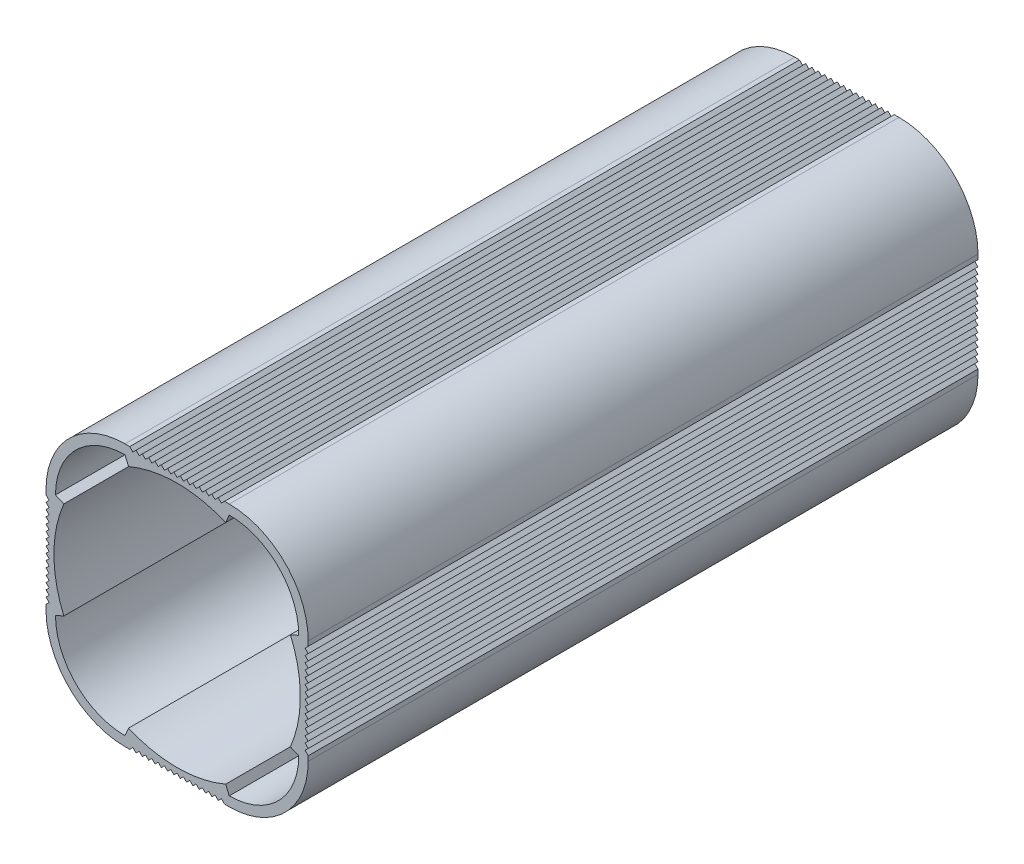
from build123d import *

# Parameters (mm, degrees)
ESQUISSE1_W                          = 83
ESQUISSE1_H                          = 83
BASE_EXTRUSION_DEPTH                 = 106
CONG_1_R                             = 25
ENL_V_MAT_EXTRU_1_DEPTH              = 220.973862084
ENL_V_MAT_EXTRU_2_DEPTH              = 220.973862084
R_P_TITION_LIN_AIRE1_COUNT           = 15
R_P_TITION_LIN_AIRE1_PITCH           = 2
R_P_TITION_CIRCULAIRE1_COUNT         = 4
R_P_TITION_CIRCULAIRE1_COPY_1_DEPTH  = 220.973862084
R_P_TITION_CIRCULAIRE1_COPY_2_DEPTH  = 220.973862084
R_P_TITION_CIRCULAIRE1_COPY_3_DEPTH  = 220.973862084
R_P_TITION_CIRCULAIRE1_COPY_4_DEPTH  = 220.973862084
R_P_TITION_CIRCULAIRE1_COPY_5_DEPTH  = 220.973862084
R_P_TITION_CIRCULAIRE1_COPY_6_DEPTH  = 220.973862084
R_P_TITION_CIRCULAIRE1_COPY_7_DEPTH  = 220.973862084
R_P_TITION_CIRCULAIRE1_COPY_8_DEPTH  = 220.973862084
R_P_TITION_CIRCULAIRE1_COPY_9_DEPTH  = 220.973862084
R_P_TITION_CIRCULAIRE1_COPY_10_DEPTH = 220.973862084
R_P_TITION_CIRCULAIRE1_COPY_11_DEPTH = 220.973862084
R_P_TITION_CIRCULAIRE1_COPY_12_DEPTH = 220.973862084
R_P_TITION_CIRCULAIRE1_COPY_13_DEPTH = 220.973862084
R_P_TITION_CIRCULAIRE1_COPY_14_DEPTH = 220.973862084
R_P_TITION_CIRCULAIRE1_COPY_15_DEPTH = 220.973862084
R_P_TITION_CIRCULAIRE1_COPY_16_DEPTH = 220.973862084
R_P_TITION_CIRCULAIRE1_COPY_17_DEPTH = 220.973862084
R_P_TITION_CIRCULAIRE1_COPY_18_DEPTH = 220.973862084
R_P_TITION_CIRCULAIRE1_COPY_19_DEPTH = 220.973862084
R_P_TITION_CIRCULAIRE1_COPY_20_DEPTH = 220.973862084
R_P_TITION_CIRCULAIRE1_COPY_21_DEPTH = 220.973862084
R_P_TITION_CIRCULAIRE1_COPY_22_DEPTH = 220.973862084
R_P_TITION_CIRCULAIRE1_COPY_23_DEPTH = 220.973862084
R_P_TITION_CIRCULAIRE1_COPY_24_DEPTH = 220.973862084
R_P_TITION_CIRCULAIRE1_COPY_25_DEPTH = 220.973862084
R_P_TITION_CIRCULAIRE1_COPY_26_DEPTH = 220.973862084
R_P_TITION_CIRCULAIRE1_COPY_27_DEPTH = 220.973862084
R_P_TITION_CIRCULAIRE1_COPY_28_DEPTH = 220.973862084
R_P_TITION_CIRCULAIRE1_COPY_29_DEPTH = 220.973862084
R_P_TITION_CIRCULAIRE1_COPY_30_DEPTH = 220.973862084
R_P_TITION_CIRCULAIRE1_COPY_31_DEPTH = 220.973862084
R_P_TITION_CIRCULAIRE1_COPY_32_DEPTH = 220.973862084
R_P_TITION_CIRCULAIRE1_COPY_33_DEPTH = 220.973862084
R_P_TITION_CIRCULAIRE1_COPY_34_DEPTH = 220.973862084
R_P_TITION_CIRCULAIRE1_COPY_35_DEPTH = 220.973862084
R_P_TITION_CIRCULAIRE1_COPY_36_DEPTH = 220.973862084
R_P_TITION_CIRCULAIRE1_COPY_37_DEPTH = 220.973862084
R_P_TITION_CIRCULAIRE1_COPY_38_DEPTH = 220.973862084
R_P_TITION_CIRCULAIRE1_COPY_39_DEPTH = 220.973862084
R_P_TITION_CIRCULAIRE1_COPY_40_DEPTH = 220.973862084
R_P_TITION_CIRCULAIRE1_COPY_41_DEPTH = 220.973862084
R_P_TITION_CIRCULAIRE1_COPY_42_DEPTH = 220.973862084


with BuildPart() as part:
    # Esquisse1 → Base-Extrusion (new, symmetric)
    with BuildSketch(Plane.XY):
        Rectangle(ESQUISSE1_W, ESQUISSE1_H)
    extrude(amount=BASE_EXTRUSION_DEPTH, both=True)

    # Cong_1
    cong_1_edges = [part.edges().sort_by_distance(p)[0] for p in [
        (-41.5, 41.5, 0),
        (41.5, 41.5, 0),
        (41.5, -41.5, 0),
        (-41.5, -41.5, 0),
    ]]
    fillet(cong_1_edges, radius=CONG_1_R)

    # Esquisse2 → Enl_v. mat.-Extru.1 (cut, through all)
    with BuildSketch(Plane.XY.offset(106)):
        with BuildLine():
            Line((15.362852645, 35.846656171), (16.5, 38.5))
            ThreePointArc((16.5, 38.5), (32.056349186, 32.056349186), (38.5, 16.5))
            Line((38.5, 16.5), (35.846656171, 15.362852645))
            ThreePointArc((35.846656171, 15.362852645), (39, 0), (35.846656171, -15.362852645))
            Line((35.846656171, -15.362852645), (38.5, -16.5))
            ThreePointArc((38.5, -16.5), (32.056349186, -32.056349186), (16.5, -38.5))
            Line((16.5, -38.5), (15.362852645, -35.846656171))
            ThreePointArc((15.362852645, -35.846656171), (0, -39), (-15.362852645, -35.846656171))
            Line((-15.362852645, -35.846656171), (-16.5, -38.5))
            ThreePointArc((-16.5, -38.5), (-32.056349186, -32.056349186), (-38.5, -16.5))
            Line((-38.5, -16.5), (-35.846656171, -15.362852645))
            ThreePointArc((-35.846656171, -15.362852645), (-39, 0), (-35.846656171, 15.362852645))
            Line((-35.846656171, 15.362852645), (-38.5, 16.5))
            ThreePointArc((-38.5, 16.5), (-32.056349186, 32.056349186), (-16.5, 38.5))
            Line((-16.5, 38.5), (-15.362852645, 35.846656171))
            ThreePointArc((-15.362852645, 35.846656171), (0, 39), (15.362852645, 35.846656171))
        make_face()
    extrude(amount=-ENL_V_MAT_EXTRU_1_DEPTH, mode=Mode.SUBTRACT)

    # Esquisse3 → Enl_v. mat.-Extru.2 (cut, through all)
    with BuildSketch(Plane.XY.offset(106)):
        Polygon((-15, 41.5), (-13, 41.5), (-14, 40.5), align=None)
    enl_v_mat_extru_2 = extrude(amount=-ENL_V_MAT_EXTRU_2_DEPTH, mode=Mode.SUBTRACT)

    # R_p_tition lin_aire1: Enl_v. mat.-Extru.2 ×15
    with Locations(*[(i * R_P_TITION_LIN_AIRE1_PITCH, 0, 0) for i in range(1, R_P_TITION_LIN_AIRE1_COUNT)]):
        add(enl_v_mat_extru_2, mode=Mode.SUBTRACT)

    # R_p_tition circulaire1: Enl_v. mat.-Extru.2 ×4 about axis
    r_p_tition_circulaire1_axis = Axis((0, 0, 0), (0, 0, 1))
    for i in range(1, R_P_TITION_CIRCULAIRE1_COUNT):
        add(enl_v_mat_extru_2.rotate(r_p_tition_circulaire1_axis, i * 360 / R_P_TITION_CIRCULAIRE1_COUNT), mode=Mode.SUBTRACT)

    # R_p_tition circulaire1 copy 1 sketch → R_p_tition circulaire1 copy 1 (cut, through all)
    with BuildSketch(Plane(origin=(0, 2, 106), x_dir=(0, 1, 0), z_dir=(0, 0, 1))):
        Polygon((-15, 41.5), (-13, 41.5), (-14, 40.5), align=None)
    extrude(amount=-R_P_TITION_CIRCULAIRE1_COPY_1_DEPTH, mode=Mode.SUBTRACT)

    # R_p_tition circulaire1 copy 2 sketch → R_p_tition circulaire1 copy 2 (cut, through all)
    with BuildSketch(Plane(origin=(-2, 0, 106), x_dir=(-1, 0, 0), z_dir=(0, 0, 1))):
        Polygon((-15, 41.5), (-13, 41.5), (-14, 40.5), align=None)
    extrude(amount=-R_P_TITION_CIRCULAIRE1_COPY_2_DEPTH, mode=Mode.SUBTRACT)

    # R_p_tition circulaire1 copy 3 sketch → R_p_tition circulaire1 copy 3 (cut, through all)
    with BuildSketch(Plane(origin=(0, -2, 106), x_dir=(0, -1, 0), z_dir=(0, 0, 1))):
        Polygon((-15, 41.5), (-13, 41.5), (-14, 40.5), align=None)
    extrude(amount=-R_P_TITION_CIRCULAIRE1_COPY_3_DEPTH, mode=Mode.SUBTRACT)

    # R_p_tition circulaire1 copy 4 sketch → R_p_tition circulaire1 copy 4 (cut, through all)
    with BuildSketch(Plane(origin=(0, 4, 106), x_dir=(0, 1, 0), z_dir=(0, 0, 1))):
        Polygon((-15, 41.5), (-13, 41.5), (-14, 40.5), align=None)
    extrude(amount=-R_P_TITION_CIRCULAIRE1_COPY_4_DEPTH, mode=Mode.SUBTRACT)

    # R_p_tition circulaire1 copy 5 sketch → R_p_tition circulaire1 copy 5 (cut, through all)
    with BuildSketch(Plane(origin=(-4, 0, 106), x_dir=(-1, 0, 0), z_dir=(0, 0, 1))):
        Polygon((-15, 41.5), (-13, 41.5), (-14, 40.5), align=None)
    extrude(amount=-R_P_TITION_CIRCULAIRE1_COPY_5_DEPTH, mode=Mode.SUBTRACT)

    # R_p_tition circulaire1 copy 6 sketch → R_p_tition circulaire1 copy 6 (cut, through all)
    with BuildSketch(Plane(origin=(0, -4, 106), x_dir=(0, -1, 0), z_dir=(0, 0, 1))):
        Polygon((-15, 41.5), (-13, 41.5), (-14, 40.5), align=None)
    extrude(amount=-R_P_TITION_CIRCULAIRE1_COPY_6_DEPTH, mode=Mode.SUBTRACT)

    # R_p_tition circulaire1 copy 7 sketch → R_p_tition circulaire1 copy 7 (cut, through all)
    with BuildSketch(Plane(origin=(0, 6, 106), x_dir=(0, 1, 0), z_dir=(0, 0, 1))):
        Polygon((-15, 41.5), (-13, 41.5), (-14, 40.5), align=None)
    extrude(amount=-R_P_TITION_CIRCULAIRE1_COPY_7_DEPTH, mode=Mode.SUBTRACT)

    # R_p_tition circulaire1 copy 8 sketch → R_p_tition circulaire1 copy 8 (cut, through all)
    with BuildSketch(Plane(origin=(-6, 0, 106), x_dir=(-1, 0, 0), z_dir=(0, 0, 1))):
        Polygon((-15, 41.5), (-13, 41.5), (-14, 40.5), align=None)
    extrude(amount=-R_P_TITION_CIRCULAIRE1_COPY_8_DEPTH, mode=Mode.SUBTRACT)

    # R_p_tition circulaire1 copy 9 sketch → R_p_tition circulaire1 copy 9 (cut, through all)
    with BuildSketch(Plane(origin=(0, -6, 106), x_dir=(0, -1, 0), z_dir=(0, 0, 1))):
        Polygon((-15, 41.5), (-13, 41.5), (-14, 40.5), align=None)
    extrude(amount=-R_P_TITION_CIRCULAIRE1_COPY_9_DEPTH, mode=Mode.SUBTRACT)

    # R_p_tition circulaire1 copy 10 sketch → R_p_tition circulaire1 copy 10 (cut, through all)
    with BuildSketch(Plane(origin=(0, 8, 106), x_dir=(0, 1, 0), z_dir=(0, 0, 1))):
        Polygon((-15, 41.5), (-13, 41.5), (-14, 40.5), align=None)
    extrude(amount=-R_P_TITION_CIRCULAIRE1_COPY_10_DEPTH, mode=Mode.SUBTRACT)

    # R_p_tition circulaire1 copy 11 sketch → R_p_tition circulaire1 copy 11 (cut, through all)
    with BuildSketch(Plane(origin=(-8, 0, 106), x_dir=(-1, 0, 0), z_dir=(0, 0, 1))):
        Polygon((-15, 41.5), (-13, 41.5), (-14, 40.5), align=None)
    extrude(amount=-R_P_TITION_CIRCULAIRE1_COPY_11_DEPTH, mode=Mode.SUBTRACT)

    # R_p_tition circulaire1 copy 12 sketch → R_p_tition circulaire1 copy 12 (cut, through all)
    with BuildSketch(Plane(origin=(0, -8, 106), x_dir=(0, -1, 0), z_dir=(0, 0, 1))):
        Polygon((-15, 41.5), (-13, 41.5), (-14, 40.5), align=None)
    extrude(amount=-R_P_TITION_CIRCULAIRE1_COPY_12_DEPTH, mode=Mode.SUBTRACT)

    # R_p_tition circulaire1 copy 13 sketch → R_p_tition circulaire1 copy 13 (cut, through all)
    with BuildSketch(Plane(origin=(0, 10, 106), x_dir=(0, 1, 0), z_dir=(0, 0, 1))):
        Polygon((-15, 41.5), (-13, 41.5), (-14, 40.5), align=None)
    extrude(amount=-R_P_TITION_CIRCULAIRE1_COPY_13_DEPTH, mode=Mode.SUBTRACT)

    # R_p_tition circulaire1 copy 14 sketch → R_p_tition circulaire1 copy 14 (cut, through all)
    with BuildSketch(Plane(origin=(-10, 0, 106), x_dir=(-1, 0, 0), z_dir=(0, 0, 1))):
        Polygon((-15, 41.5), (-13, 41.5), (-14, 40.5), align=None)
    extrude(amount=-R_P_TITION_CIRCULAIRE1_COPY_14_DEPTH, mode=Mode.SUBTRACT)

    # R_p_tition circulaire1 copy 15 sketch → R_p_tition circulaire1 copy 15 (cut, through all)
    with BuildSketch(Plane(origin=(0, -10, 106), x_dir=(0, -1, 0), z_dir=(0, 0, 1))):
        Polygon((-15, 41.5), (-13, 41.5), (-14, 40.5), align=None)
    extrude(amount=-R_P_TITION_CIRCULAIRE1_COPY_15_DEPTH, mode=Mode.SUBTRACT)

    # R_p_tition circulaire1 copy 16 sketch → R_p_tition circulaire1 copy 16 (cut, through all)
    with BuildSketch(Plane(origin=(0, 12, 106), x_dir=(0, 1, 0), z_dir=(0, 0, 1))):
        Polygon((-15, 41.5), (-13, 41.5), (-14, 40.5), align=None)
    extrude(amount=-R_P_TITION_CIRCULAIRE1_COPY_16_DEPTH, mode=Mode.SUBTRACT)

    # R_p_tition circulaire1 copy 17 sketch → R_p_tition circulaire1 copy 17 (cut, through all)
    with BuildSketch(Plane(origin=(-12, 0, 106), x_dir=(-1, 0, 0), z_dir=(0, 0, 1))):
        Polygon((-15, 41.5), (-13, 41.5), (-14, 40.5), align=None)
    extrude(amount=-R_P_TITION_CIRCULAIRE1_COPY_17_DEPTH, mode=Mode.SUBTRACT)

    # R_p_tition circulaire1 copy 18 sketch → R_p_tition circulaire1 copy 18 (cut, through all)
    with BuildSketch(Plane(origin=(0, -12, 106), x_dir=(0, -1, 0), z_dir=(0, 0, 1))):
        Polygon((-15, 41.5), (-13, 41.5), (-14, 40.5), align=None)
    extrude(amount=-R_P_TITION_CIRCULAIRE1_COPY_18_DEPTH, mode=Mode.SUBTRACT)

    # R_p_tition circulaire1 copy 19 sketch → R_p_tition circulaire1 copy 19 (cut, through all)
    with BuildSketch(Plane(origin=(0, 14, 106), x_dir=(0, 1, 0), z_dir=(0, 0, 1))):
        Polygon((-15, 41.5), (-13, 41.5), (-14, 40.5), align=None)
    extrude(amount=-R_P_TITION_CIRCULAIRE1_COPY_19_DEPTH, mode=Mode.SUBTRACT)

    # R_p_tition circulaire1 copy 20 sketch → R_p_tition circulaire1 copy 20 (cut, through all)
    with BuildSketch(Plane(origin=(-14, 0, 106), x_dir=(-1, 0, 0), z_dir=(0, 0, 1))):
        Polygon((-15, 41.5), (-13, 41.5), (-14, 40.5), align=None)
    extrude(amount=-R_P_TITION_CIRCULAIRE1_COPY_20_DEPTH, mode=Mode.SUBTRACT)

    # R_p_tition circulaire1 copy 21 sketch → R_p_tition circulaire1 copy 21 (cut, through all)
    with BuildSketch(Plane(origin=(0, -14, 106), x_dir=(0, -1, 0), z_dir=(0, 0, 1))):
        Polygon((-15, 41.5), (-13, 41.5), (-14, 40.5), align=None)
    extrude(amount=-R_P_TITION_CIRCULAIRE1_COPY_21_DEPTH, mode=Mode.SUBTRACT)

    # R_p_tition circulaire1 copy 22 sketch → R_p_tition circulaire1 copy 22 (cut, through all)
    with BuildSketch(Plane(origin=(0, 16, 106), x_dir=(0, 1, 0), z_dir=(0, 0, 1))):
        Polygon((-15, 41.5), (-13, 41.5), (-14, 40.5), align=None)
    extrude(amount=-R_P_TITION_CIRCULAIRE1_COPY_22_DEPTH, mode=Mode.SUBTRACT)

    # R_p_tition circulaire1 copy 23 sketch → R_p_tition circulaire1 copy 23 (cut, through all)
    with BuildSketch(Plane(origin=(-16, 0, 106), x_dir=(-1, 0, 0), z_dir=(0, 0, 1))):
        Polygon((-15, 41.5), (-13, 41.5), (-14, 40.5), align=None)
    extrude(amount=-R_P_TITION_CIRCULAIRE1_COPY_23_DEPTH, mode=Mode.SUBTRACT)

    # R_p_tition circulaire1 copy 24 sketch → R_p_tition circulaire1 copy 24 (cut, through all)
    with BuildSketch(Plane(origin=(0, -16, 106), x_dir=(0, -1, 0), z_dir=(0, 0, 1))):
        Polygon((-15, 41.5), (-13, 41.5), (-14, 40.5), align=None)
    extrude(amount=-R_P_TITION_CIRCULAIRE1_COPY_24_DEPTH, mode=Mode.SUBTRACT)

    # R_p_tition circulaire1 copy 25 sketch → R_p_tition circulaire1 copy 25 (cut, through all)
    with BuildSketch(Plane(origin=(0, 18, 106), x_dir=(0, 1, 0), z_dir=(0, 0, 1))):
        Polygon((-15, 41.5), (-13, 41.5), (-14, 40.5), align=None)
    extrude(amount=-R_P_TITION_CIRCULAIRE1_COPY_25_DEPTH, mode=Mode.SUBTRACT)

    # R_p_tition circulaire1 copy 26 sketch → R_p_tition circulaire1 copy 26 (cut, through all)
    with BuildSketch(Plane(origin=(-18, 0, 106), x_dir=(-1, 0, 0), z_dir=(0, 0, 1))):
        Polygon((-15, 41.5), (-13, 41.5), (-14, 40.5), align=None)
    extrude(amount=-R_P_TITION_CIRCULAIRE1_COPY_26_DEPTH, mode=Mode.SUBTRACT)

    # R_p_tition circulaire1 copy 27 sketch → R_p_tition circulaire1 copy 27 (cut, through all)
    with BuildSketch(Plane(origin=(0, -18, 106), x_dir=(0, -1, 0), z_dir=(0, 0, 1))):
        Polygon((-15, 41.5), (-13, 41.5), (-14, 40.5), align=None)
    extrude(amount=-R_P_TITION_CIRCULAIRE1_COPY_27_DEPTH, mode=Mode.SUBTRACT)

    # R_p_tition circulaire1 copy 28 sketch → R_p_tition circulaire1 copy 28 (cut, through all)
    with BuildSketch(Plane(origin=(0, 20, 106), x_dir=(0, 1, 0), z_dir=(0, 0, 1))):
        Polygon((-15, 41.5), (-13, 41.5), (-14, 40.5), align=None)
    extrude(amount=-R_P_TITION_CIRCULAIRE1_COPY_28_DEPTH, mode=Mode.SUBTRACT)

    # R_p_tition circulaire1 copy 29 sketch → R_p_tition circulaire1 copy 29 (cut, through all)
    with BuildSketch(Plane(origin=(-20, 0, 106), x_dir=(-1, 0, 0), z_dir=(0, 0, 1))):
        Polygon((-15, 41.5), (-13, 41.5), (-14, 40.5), align=None)
    extrude(amount=-R_P_TITION_CIRCULAIRE1_COPY_29_DEPTH, mode=Mode.SUBTRACT)

    # R_p_tition circulaire1 copy 30 sketch → R_p_tition circulaire1 copy 30 (cut, through all)
    with BuildSketch(Plane(origin=(0, -20, 106), x_dir=(0, -1, 0), z_dir=(0, 0, 1))):
        Polygon((-15, 41.5), (-13, 41.5), (-14, 40.5), align=None)
    extrude(amount=-R_P_TITION_CIRCULAIRE1_COPY_30_DEPTH, mode=Mode.SUBTRACT)

    # R_p_tition circulaire1 copy 31 sketch → R_p_tition circulaire1 copy 31 (cut, through all)
    with BuildSketch(Plane(origin=(0, 22, 106), x_dir=(0, 1, 0), z_dir=(0, 0, 1))):
        Polygon((-15, 41.5), (-13, 41.5), (-14, 40.5), align=None)
    extrude(amount=-R_P_TITION_CIRCULAIRE1_COPY_31_DEPTH, mode=Mode.SUBTRACT)

    # R_p_tition circulaire1 copy 32 sketch → R_p_tition circulaire1 copy 32 (cut, through all)
    with BuildSketch(Plane(origin=(-22, 0, 106), x_dir=(-1, 0, 0), z_dir=(0, 0, 1))):
        Polygon((-15, 41.5), (-13, 41.5), (-14, 40.5), align=None)
    extrude(amount=-R_P_TITION_CIRCULAIRE1_COPY_32_DEPTH, mode=Mode.SUBTRACT)

    # R_p_tition circulaire1 copy 33 sketch → R_p_tition circulaire1 copy 33 (cut, through all)
    with BuildSketch(Plane(origin=(0, -22, 106), x_dir=(0, -1, 0), z_dir=(0, 0, 1))):
        Polygon((-15, 41.5), (-13, 41.5), (-14, 40.5), align=None)
    extrude(amount=-R_P_TITION_CIRCULAIRE1_COPY_33_DEPTH, mode=Mode.SUBTRACT)

    # R_p_tition circulaire1 copy 34 sketch → R_p_tition circulaire1 copy 34 (cut, through all)
    with BuildSketch(Plane(origin=(0, 24, 106), x_dir=(0, 1, 0), z_dir=(0, 0, 1))):
        Polygon((-15, 41.5), (-13, 41.5), (-14, 40.5), align=None)
    extrude(amount=-R_P_TITION_CIRCULAIRE1_COPY_34_DEPTH, mode=Mode.SUBTRACT)

    # R_p_tition circulaire1 copy 35 sketch → R_p_tition circulaire1 copy 35 (cut, through all)
    with BuildSketch(Plane(origin=(-24, 0, 106), x_dir=(-1, 0, 0), z_dir=(0, 0, 1))):
        Polygon((-15, 41.5), (-13, 41.5), (-14, 40.5), align=None)
    extrude(amount=-R_P_TITION_CIRCULAIRE1_COPY_35_DEPTH, mode=Mode.SUBTRACT)

    # R_p_tition circulaire1 copy 36 sketch → R_p_tition circulaire1 copy 36 (cut, through all)
    with BuildSketch(Plane(origin=(0, -24, 106), x_dir=(0, -1, 0), z_dir=(0, 0, 1))):
        Polygon((-15, 41.5), (-13, 41.5), (-14, 40.5), align=None)
    extrude(amount=-R_P_TITION_CIRCULAIRE1_COPY_36_DEPTH, mode=Mode.SUBTRACT)

    # R_p_tition circulaire1 copy 37 sketch → R_p_tition circulaire1 copy 37 (cut, through all)
    with BuildSketch(Plane(origin=(0, 26, 106), x_dir=(0, 1, 0), z_dir=(0, 0, 1))):
        Polygon((-15, 41.5), (-13, 41.5), (-14, 40.5), align=None)
    extrude(amount=-R_P_TITION_CIRCULAIRE1_COPY_37_DEPTH, mode=Mode.SUBTRACT)

    # R_p_tition circulaire1 copy 38 sketch → R_p_tition circulaire1 copy 38 (cut, through all)
    with BuildSketch(Plane(origin=(-26, 0, 106), x_dir=(-1, 0, 0), z_dir=(0, 0, 1))):
        Polygon((-15, 41.5), (-13, 41.5), (-14, 40.5), align=None)
    extrude(amount=-R_P_TITION_CIRCULAIRE1_COPY_38_DEPTH, mode=Mode.SUBTRACT)

    # R_p_tition circulaire1 copy 39 sketch → R_p_tition circulaire1 copy 39 (cut, through all)
    with BuildSketch(Plane(origin=(0, -26, 106), x_dir=(0, -1, 0), z_dir=(0, 0, 1))):
        Polygon((-15, 41.5), (-13, 41.5), (-14, 40.5), align=None)
    extrude(amount=-R_P_TITION_CIRCULAIRE1_COPY_39_DEPTH, mode=Mode.SUBTRACT)

    # R_p_tition circulaire1 copy 40 sketch → R_p_tition circulaire1 copy 40 (cut, through all)
    with BuildSketch(Plane(origin=(0, 28, 106), x_dir=(0, 1, 0), z_dir=(0, 0, 1))):
        Polygon((-15, 41.5), (-13, 41.5), (-14, 40.5), align=None)
    extrude(amount=-R_P_TITION_CIRCULAIRE1_COPY_40_DEPTH, mode=Mode.SUBTRACT)

    # R_p_tition circulaire1 copy 41 sketch → R_p_tition circulaire1 copy 41 (cut, through all)
    with BuildSketch(Plane(origin=(-28, 0, 106), x_dir=(-1, 0, 0), z_dir=(0, 0, 1))):
        Polygon((-15, 41.5), (-13, 41.5), (-14, 40.5), align=None)
    extrude(amount=-R_P_TITION_CIRCULAIRE1_COPY_41_DEPTH, mode=Mode.SUBTRACT)

    # R_p_tition circulaire1 copy 42 sketch → R_p_tition circulaire1 copy 42 (cut, through all)
    with BuildSketch(Plane(origin=(0, -28, 106), x_dir=(0, -1, 0), z_dir=(0, 0, 1))):
        Polygon((-15, 41.5), (-13, 41.5), (-14, 40.5), align=None)
    extrude(amount=-R_P_TITION_CIRCULAIRE1_COPY_42_DEPTH, mode=Mode.SUBTRACT)


solid = part.part
